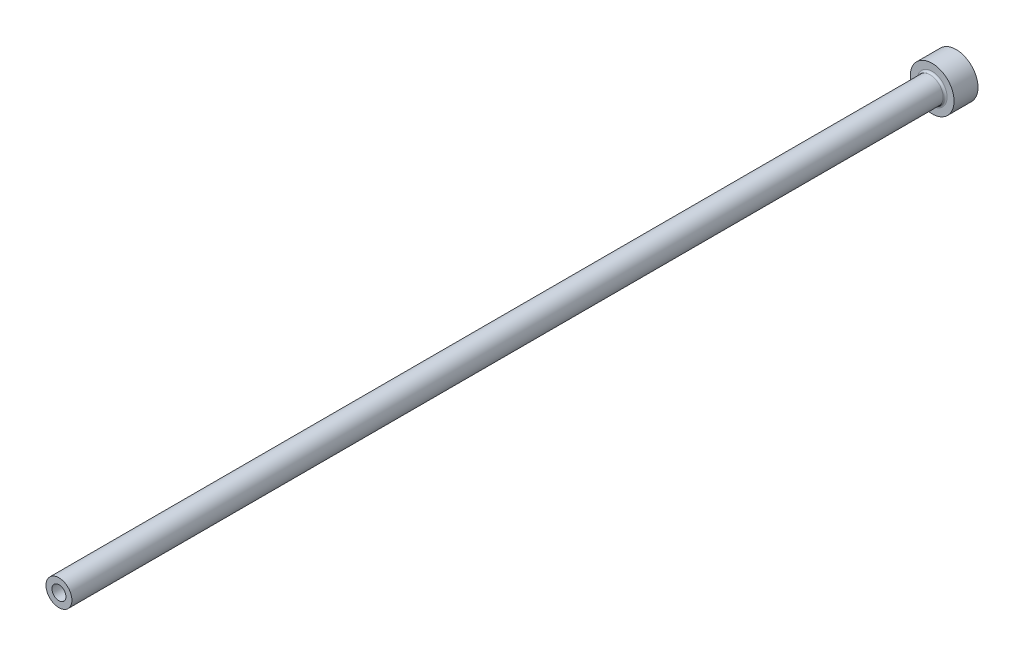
from build123d import *

# Parameters (mm, degrees)
HEAD_FILLET_R          = 0.5
ID_RELIEF_CHAMFER_SIZE = 0.5


with BuildPart() as part:
    # OD FV → Base Revolve (revolve)
    with BuildSketch(Plane(origin=(0, 0, 0), x_dir=(1, 0, 0), z_dir=(0, 1, 0))):
        Polygon((0, -225), (3.25, -225), (3.25, -6), (5.5, -6), (5.5, 0), (0, 0), align=None)
    revolve(axis=Axis((0, 0, 225), (0, 0, -1)))

    # ID FV → Hole (revolve, cut)
    with BuildSketch(Plane(origin=(0, 0, 0), x_dir=(1, 0, 0), z_dir=(0, 1, 0))):
        Polygon((0, -225), (1.75, -225), (1.75, -125), (2, -124.566987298), (2, 0), (0, 0), align=None)
    revolve(axis=Axis((0, 0, 225), (0, 0, -1)), mode=Mode.SUBTRACT)

    # Head Fillet
    head_fillet_edges = [part.edges().sort_by_distance(p)[0] for p in [
        (-3.25, 0, 6),
    ]]
    fillet(head_fillet_edges, radius=HEAD_FILLET_R)

    # ID Relief Chamfer
    id_relief_chamfer_edges = [part.edges().sort_by_distance(p)[0] for p in [
        (-2, 0, 0),
    ]]
    chamfer(id_relief_chamfer_edges, length=ID_RELIEF_CHAMFER_SIZE)


solid = part.part
